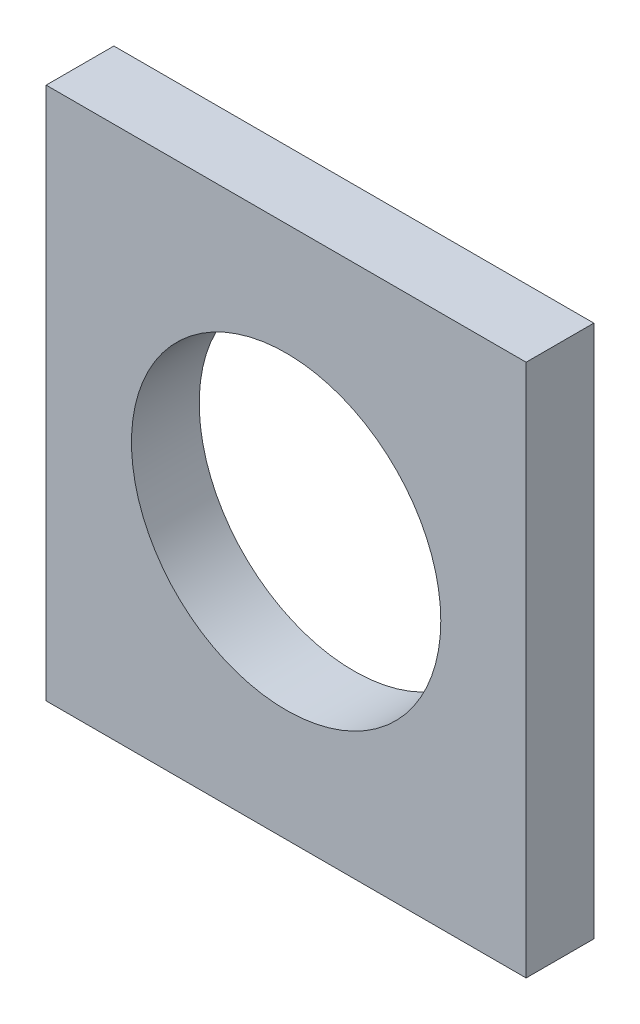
from build123d import *

# Parameters (mm, degrees)
SKETCH1_W           = 45
SKETCH1_H           = 50
SKETCH1_R           = 14.5
BOSS_EXTRUDE1_DEPTH = 6.35


with BuildPart() as part:
    # Sketch1 → Boss-Extrude1 (new body)
    with BuildSketch(Plane.XY):
        with Locations((22.5, 25)):
            Rectangle(SKETCH1_W, SKETCH1_H)
        with Locations((22.5, 25)):
            Circle(SKETCH1_R, mode=Mode.SUBTRACT)
    extrude(amount=BOSS_EXTRUDE1_DEPTH)


solid = part.part
